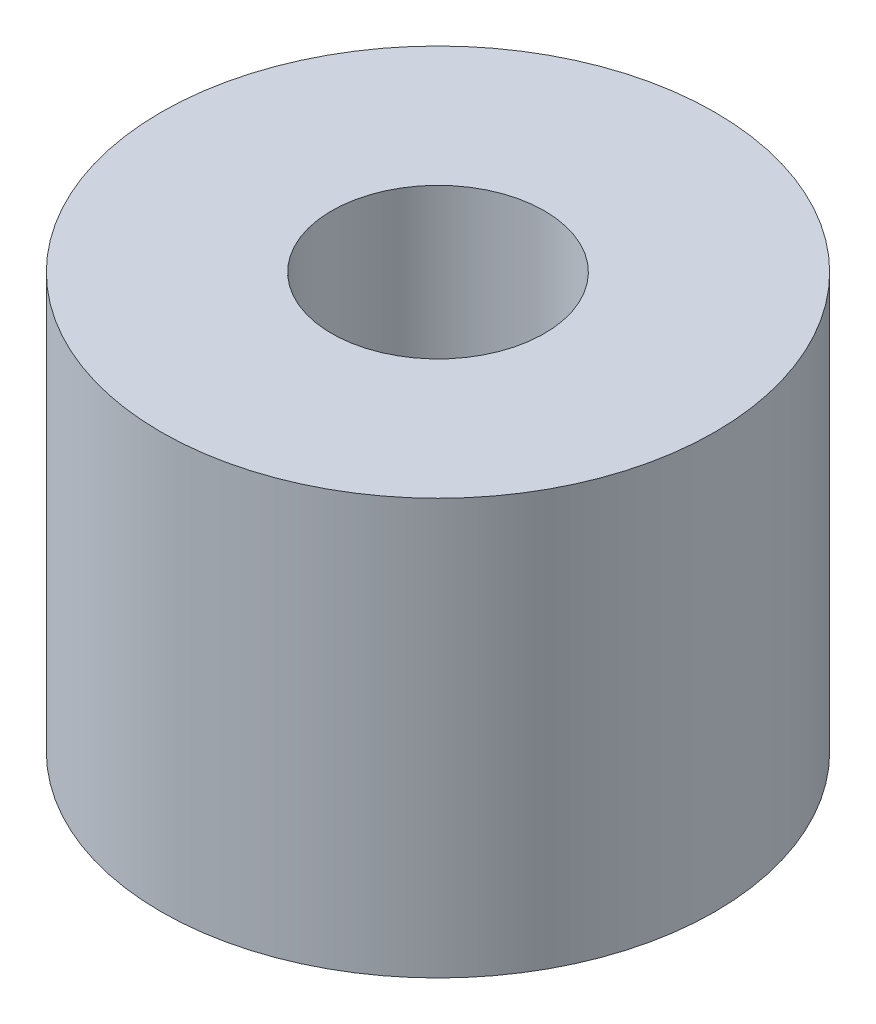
from build123d import *

# Parameters (mm, degrees)
SKETCH1_R           = 6.35
SKETCH1_R_2         = 2.4384
BOSS_EXTRUDE1_DEPTH = 9.525


with BuildPart() as part:
    # Sketch1 → Boss-Extrude1 (new body)
    with BuildSketch(Plane(origin=(0, 0, 0), x_dir=(1, 0, 0), z_dir=(0, 1, 0))):
        with Locations(Location((0, 0, 0), (0, 0, 90))):
            Circle(SKETCH1_R)
        with Locations(Location((0, 0, 0), (0, 0, 90))):
            Circle(SKETCH1_R_2, mode=Mode.SUBTRACT)
    extrude(amount=BOSS_EXTRUDE1_DEPTH)


solid = part.part
